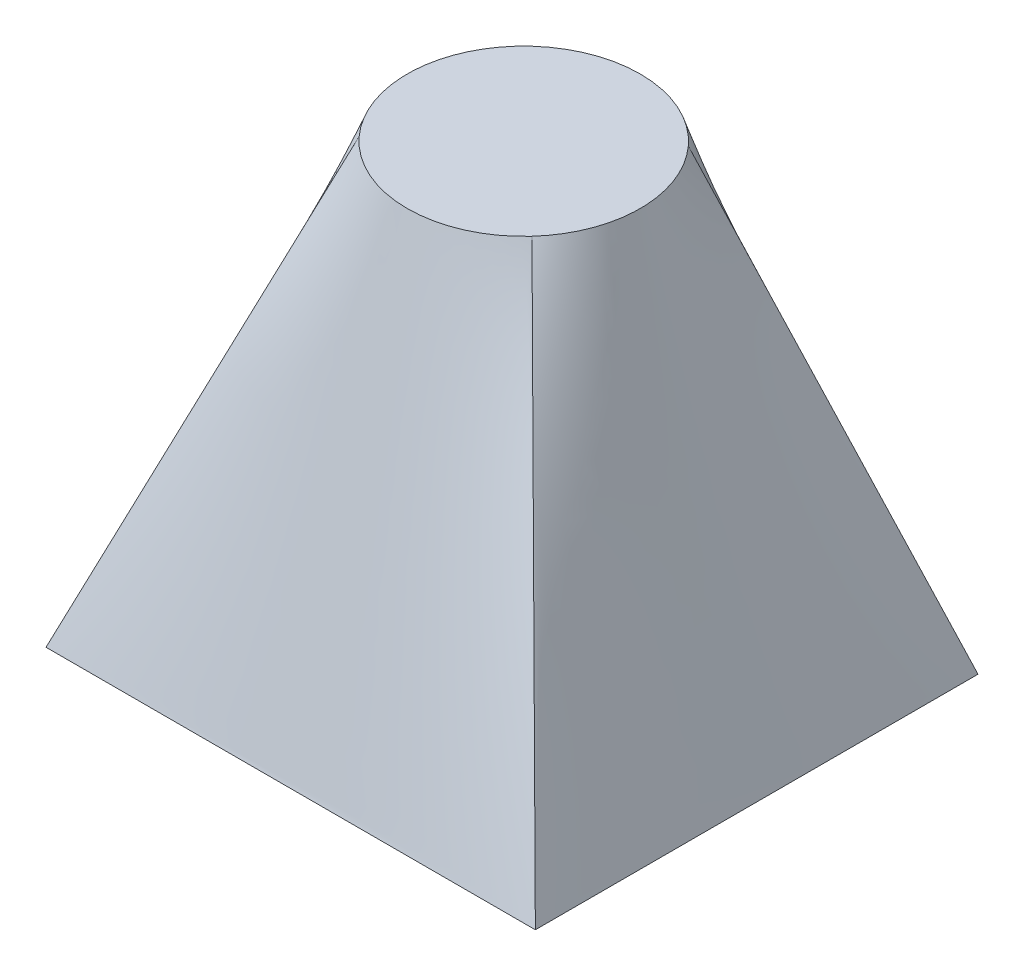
ISO-10303-21;
HEADER;
FILE_DESCRIPTION(('STEP AP214'),'2;1');
FILE_NAME('part.step','',(''),(''),'','','');
FILE_SCHEMA(('AUTOMOTIVE_DESIGN { 1 0 10303 214 1 1 1 1 }'));
ENDSEC;
DATA;
#1=APPLICATION_CONTEXT('core data for automotive mechanical design processes');
#2=APPLICATION_PROTOCOL_DEFINITION('international standard','automotive_design',2000,#1);
#3=PRODUCT_CONTEXT('',#1,'mechanical');
#4=PRODUCT('Part','Part','',(#3));
#5=PRODUCT_RELATED_PRODUCT_CATEGORY('part','',(#4));
#6=PRODUCT_DEFINITION_FORMATION('','',#4);
#7=PRODUCT_DEFINITION_CONTEXT('part definition',#1,'design');
#8=PRODUCT_DEFINITION('design','',#6,#7);
#9=PRODUCT_DEFINITION_SHAPE('','',#8);
#10=(LENGTH_UNIT() NAMED_UNIT(*) SI_UNIT(.MILLI.,.METRE.));
#11=(NAMED_UNIT(*) PLANE_ANGLE_UNIT() SI_UNIT($,.RADIAN.));
#12=(NAMED_UNIT(*) SI_UNIT($,.STERADIAN.) SOLID_ANGLE_UNIT());
#13=UNCERTAINTY_MEASURE_WITH_UNIT(LENGTH_MEASURE(1.E-05),#10,'distance_accuracy_value','');
#14=(GEOMETRIC_REPRESENTATION_CONTEXT(3) GLOBAL_UNCERTAINTY_ASSIGNED_CONTEXT((#13)) GLOBAL_UNIT_ASSIGNED_CONTEXT((#10,
#11,#12)) REPRESENTATION_CONTEXT('',''));
#15=CARTESIAN_POINT('',(0.,0.,0.));
#16=DIRECTION('',(0.,0.,1.));
#17=DIRECTION('',(1.,0.,0.));
#18=AXIS2_PLACEMENT_3D('',#15,#16,#17);
#19=CARTESIAN_POINT('',(0.,50.,0.));
#20=DIRECTION('',(0.,1.,0.));
#21=DIRECTION('',(0.,0.,1.));
#22=AXIS2_PLACEMENT_3D('',#19,#20,#21);
#23=PLANE('',#22);
#24=CARTESIAN_POINT('',(0.,50.,0.));
#25=DIRECTION('',(0.,1.,0.));
#26=DIRECTION('',(0.,0.,1.));
#27=AXIS2_PLACEMENT_3D('',#24,#25,#26);
#28=CIRCLE('',#27,13.121254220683);
#29=CARTESIAN_POINT('',(9.73080163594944,50.,8.80220494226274));
#30=VERTEX_POINT('',#29);
#31=CARTESIAN_POINT('',(9.73080163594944,50.,-8.80220494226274));
#32=VERTEX_POINT('',#31);
#33=EDGE_CURVE('E35',#30,#32,#28,.T.);
#34=ORIENTED_EDGE('',*,*,#33,.T.);
#35=CARTESIAN_POINT('',(-9.73080163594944,50.,-8.80220494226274));
#36=VERTEX_POINT('',#35);
#37=EDGE_CURVE('E69',#32,#36,#28,.T.);
#38=ORIENTED_EDGE('',*,*,#37,.T.);
#39=CARTESIAN_POINT('',(-9.73080163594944,50.,8.80220494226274));
#40=VERTEX_POINT('',#39);
#41=EDGE_CURVE('E72',#36,#40,#28,.T.);
#42=ORIENTED_EDGE('',*,*,#41,.T.);
#43=EDGE_CURVE('E75',#40,#30,#28,.T.);
#44=ORIENTED_EDGE('',*,*,#43,.T.);
#45=EDGE_LOOP('',(#34,#38,#42,#44));
#46=FACE_BOUND('',#45,.T.);
#47=ADVANCED_FACE('F32',(#46),#23,.T.);
#48=CARTESIAN_POINT('',(-27.549770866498,0.,26.2411160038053));
#49=DIRECTION('',(0.,-1.,0.));
#50=DIRECTION('',(0.,0.,-1.));
#51=AXIS2_PLACEMENT_3D('',#48,#49,#50);
#52=PLANE('',#51);
#53=DIRECTION('',(0.,0.,1.));
#54=VECTOR('',#53,1.);
#55=CARTESIAN_POINT('',(-27.549770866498,0.,26.2411160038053));
#56=LINE('',#55,#54);
#57=CARTESIAN_POINT('',(-27.549770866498,0.,-23.6003540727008));
#58=VERTEX_POINT('',#57);
#59=CARTESIAN_POINT('',(-27.549770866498,0.,26.2411160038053));
#60=VERTEX_POINT('',#59);
#61=EDGE_CURVE('E83',#58,#60,#56,.T.);
#62=ORIENTED_EDGE('',*,*,#61,.F.);
#63=DIRECTION('',(-1.,0.,0.));
#64=VECTOR('',#63,1.);
#65=CARTESIAN_POINT('',(-27.549770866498,0.,-23.6003540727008));
#66=LINE('',#65,#64);
#67=CARTESIAN_POINT('',(27.549770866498,0.,-23.6003540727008));
#68=VERTEX_POINT('',#67);
#69=EDGE_CURVE('E96',#68,#58,#66,.T.);
#70=ORIENTED_EDGE('',*,*,#69,.F.);
#71=DIRECTION('',(0.,0.,-1.));
#72=VECTOR('',#71,1.);
#73=CARTESIAN_POINT('',(27.549770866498,0.,26.2411160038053));
#74=LINE('',#73,#72);
#75=CARTESIAN_POINT('',(27.549770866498,0.,26.2411160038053));
#76=VERTEX_POINT('',#75);
#77=EDGE_CURVE('E41',#76,#68,#74,.T.);
#78=ORIENTED_EDGE('',*,*,#77,.F.);
#79=DIRECTION('',(1.,0.,0.));
#80=VECTOR('',#79,1.);
#81=CARTESIAN_POINT('',(-27.549770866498,0.,26.2411160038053));
#82=LINE('',#81,#80);
#83=EDGE_CURVE('E11',#60,#76,#82,.T.);
#84=ORIENTED_EDGE('',*,*,#83,.F.);
#85=EDGE_LOOP('',(#62,#70,#78,#84));
#86=FACE_BOUND('',#85,.T.);
#87=ADVANCED_FACE('F103',(#86),#52,.T.);
#88=CARTESIAN_POINT('',(27.549770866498,0.,26.2411160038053));
#89=CARTESIAN_POINT('',(9.73080163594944,50.,8.80220494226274));
#90=CARTESIAN_POINT('',(27.549770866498,0.,9.62729264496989));
#91=CARTESIAN_POINT('',(14.4866037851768,50.,3.54468507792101));
#92=CARTESIAN_POINT('',(27.549770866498,0.,-6.98653071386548));
#93=CARTESIAN_POINT('',(14.4866037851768,50.,-3.54468507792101));
#94=CARTESIAN_POINT('',(27.549770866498,0.,-23.6003540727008));
#95=CARTESIAN_POINT('',(9.73080163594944,50.,-8.80220494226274));
#96=(BOUNDED_SURFACE() B_SPLINE_SURFACE(3,1,((#88,#89),(#90,#91),(#92,#93),(#94,#95)),
.UNSPECIFIED.,.F.,.F.,.F.) B_SPLINE_SURFACE_WITH_KNOTS((4,4),(2,2),(0.,1.),(0.,1.),
.UNSPECIFIED.) GEOMETRIC_REPRESENTATION_ITEM() RATIONAL_B_SPLINE_SURFACE(((1.,1.),(1.,
0.827737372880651),(1.,0.827737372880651),(1.,1.))) REPRESENTATION_ITEM('') SURFACE());
#97=DIRECTION('',(-0.323367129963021,0.907367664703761,0.268547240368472));
#98=VECTOR('',#97,1.);
#99=CARTESIAN_POINT('',(18.6402862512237,25.,-16.2012795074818));
#100=LINE('',#99,#98);
#101=EDGE_CURVE('E91',#68,#32,#100,.T.);
#102=DIRECTION('',(0.318927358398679,-0.894909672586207,0.3121250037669));
#103=VECTOR('',#102,1.);
#104=CARTESIAN_POINT('',(18.6402862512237,25.,17.521660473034));
#105=LINE('',#104,#103);
#106=EDGE_CURVE('E50',#30,#76,#105,.T.);
#107=ORIENTED_EDGE('',*,*,#77,.T.);
#108=ORIENTED_EDGE('',*,*,#101,.T.);
#109=ORIENTED_EDGE('',*,*,#33,.F.);
#110=ORIENTED_EDGE('',*,*,#106,.T.);
#111=EDGE_LOOP('',(#107,#108,#109,#110));
#112=FACE_BOUND('',#111,.T.);
#113=ADVANCED_FACE('F92',(#112),#96,.T.);
#114=CARTESIAN_POINT('',(27.549770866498,0.,-23.6003540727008));
#115=CARTESIAN_POINT('',(9.73080163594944,50.,-8.80220494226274));
#116=CARTESIAN_POINT('',(9.18325695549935,0.,-23.6003540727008));
#117=CARTESIAN_POINT('',(4.15549429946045,50.,-14.96568444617));
#118=CARTESIAN_POINT('',(-9.18325695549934,0.,-23.6003540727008));
#119=CARTESIAN_POINT('',(-4.15549429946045,50.,-14.96568444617));
#120=CARTESIAN_POINT('',(-27.549770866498,0.,-23.6003540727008));
#121=CARTESIAN_POINT('',(-9.73080163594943,50.,-8.80220494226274));
#122=(BOUNDED_SURFACE() B_SPLINE_SURFACE(3,1,((#114,#115),(#116,#117),(#118,#119),(#120,#121)),
.UNSPECIFIED.,.F.,.F.,.F.) B_SPLINE_SURFACE_WITH_KNOTS((4,4),(2,2),(0.,1.),(0.,1.),
.UNSPECIFIED.) GEOMETRIC_REPRESENTATION_ITEM() RATIONAL_B_SPLINE_SURFACE(((1.,1.),(1.,
0.780557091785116),(1.,0.780557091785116),(1.,1.))) REPRESENTATION_ITEM('') SURFACE());
#123=DIRECTION('',(0.323367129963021,0.907367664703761,0.268547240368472));
#124=VECTOR('',#123,1.);
#125=CARTESIAN_POINT('',(-18.6402862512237,25.,-16.2012795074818));
#126=LINE('',#125,#124);
#127=EDGE_CURVE('E85',#58,#36,#126,.T.);
#128=ORIENTED_EDGE('',*,*,#69,.T.);
#129=ORIENTED_EDGE('',*,*,#127,.T.);
#130=ORIENTED_EDGE('',*,*,#37,.F.);
#131=ORIENTED_EDGE('',*,*,#101,.F.);
#132=EDGE_LOOP('',(#128,#129,#130,#131));
#133=FACE_BOUND('',#132,.T.);
#134=ADVANCED_FACE('F90',(#133),#122,.T.);
#135=CARTESIAN_POINT('',(-27.549770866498,0.,26.2411160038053));
#136=CARTESIAN_POINT('',(-9.73080163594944,50.,8.80220494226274));
#137=CARTESIAN_POINT('',(-9.18325695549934,0.,26.2411160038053));
#138=CARTESIAN_POINT('',(-4.15549429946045,50.,14.96568444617));
#139=CARTESIAN_POINT('',(9.18325695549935,0.,26.2411160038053));
#140=CARTESIAN_POINT('',(4.15549429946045,50.,14.96568444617));
#141=CARTESIAN_POINT('',(27.549770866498,0.,26.2411160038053));
#142=CARTESIAN_POINT('',(9.73080163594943,50.,8.80220494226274));
#143=(BOUNDED_SURFACE() B_SPLINE_SURFACE(3,1,((#135,#136),(#137,#138),(#139,#140),(#141,#142)),
.UNSPECIFIED.,.F.,.F.,.F.) B_SPLINE_SURFACE_WITH_KNOTS((4,4),(2,2),(0.,1.),(0.,1.),
.UNSPECIFIED.) GEOMETRIC_REPRESENTATION_ITEM() RATIONAL_B_SPLINE_SURFACE(((1.,1.),(1.,
0.780557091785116),(1.,0.780557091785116),(1.,1.))) REPRESENTATION_ITEM('') SURFACE());
#144=DIRECTION('',(-0.318927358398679,-0.894909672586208,0.3121250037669));
#145=VECTOR('',#144,1.);
#146=CARTESIAN_POINT('',(-18.6402862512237,25.,17.521660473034));
#147=LINE('',#146,#145);
#148=EDGE_CURVE('E80',#40,#60,#147,.T.);
#149=ORIENTED_EDGE('',*,*,#83,.T.);
#150=ORIENTED_EDGE('',*,*,#106,.F.);
#151=ORIENTED_EDGE('',*,*,#43,.F.);
#152=ORIENTED_EDGE('',*,*,#148,.T.);
#153=EDGE_LOOP('',(#149,#150,#151,#152));
#154=FACE_BOUND('',#153,.T.);
#155=ADVANCED_FACE('F86',(#154),#143,.T.);
#156=CARTESIAN_POINT('',(-27.549770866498,0.,-23.6003540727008));
#157=CARTESIAN_POINT('',(-9.73080163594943,50.,-8.80220494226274));
#158=CARTESIAN_POINT('',(-27.549770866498,0.,-6.98653071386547));
#159=CARTESIAN_POINT('',(-14.4866037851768,50.,-3.54468507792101));
#160=CARTESIAN_POINT('',(-27.549770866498,0.,9.62729264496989));
#161=CARTESIAN_POINT('',(-14.4866037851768,50.,3.544685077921));
#162=CARTESIAN_POINT('',(-27.549770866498,0.,26.2411160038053));
#163=CARTESIAN_POINT('',(-9.73080163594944,50.,8.80220494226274));
#164=(BOUNDED_SURFACE() B_SPLINE_SURFACE(3,1,((#156,#157),(#158,#159),(#160,#161),(#162,#163)),
.UNSPECIFIED.,.F.,.F.,.F.) B_SPLINE_SURFACE_WITH_KNOTS((4,4),(2,2),(0.,1.),(0.,1.),
.UNSPECIFIED.) GEOMETRIC_REPRESENTATION_ITEM() RATIONAL_B_SPLINE_SURFACE(((1.,1.),(1.,
0.827737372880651),(1.,0.827737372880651),(1.,1.))) REPRESENTATION_ITEM('') SURFACE());
#165=ORIENTED_EDGE('',*,*,#61,.T.);
#166=ORIENTED_EDGE('',*,*,#148,.F.);
#167=ORIENTED_EDGE('',*,*,#41,.F.);
#168=ORIENTED_EDGE('',*,*,#127,.F.);
#169=EDGE_LOOP('',(#165,#166,#167,#168));
#170=FACE_BOUND('',#169,.T.);
#171=ADVANCED_FACE('F81',(#170),#164,.T.);
#172=CLOSED_SHELL('',(#47,#87,#113,#134,#155,#171));
#173=MANIFOLD_SOLID_BREP('B2',#172);
#174=ADVANCED_BREP_SHAPE_REPRESENTATION('',(#18,#173),#14);
#175=SHAPE_DEFINITION_REPRESENTATION(#9,#174);
ENDSEC;
END-ISO-10303-21;
